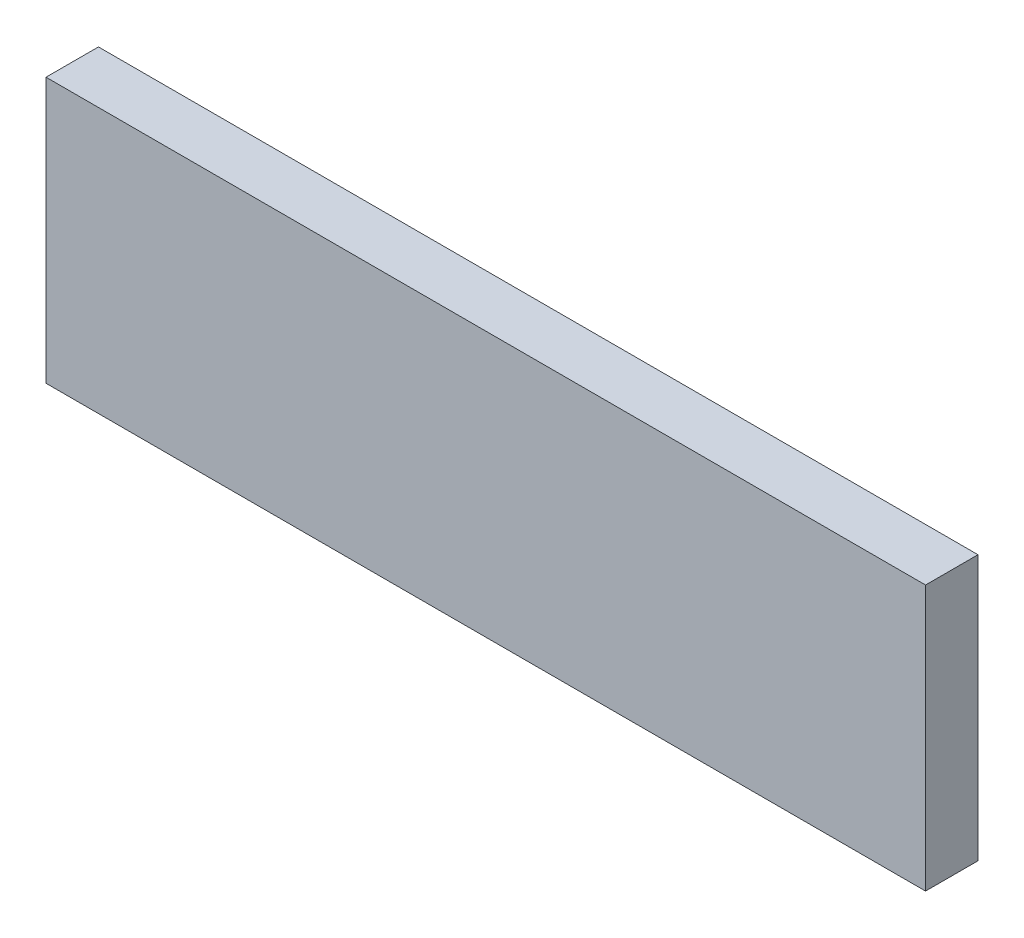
from build123d import *

# Parameters (mm, degrees)
SKIZZE1_W                       = 167.680604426
SKIZZE1_H                       = 50.537359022
AUFSATZ_LINEAR_AUSTRAGEN1_DEPTH = 10


with BuildPart() as part:
    # Skizze1 → Aufsatz-Linear austragen1 (new body)
    with BuildSketch(Plane.XY):
        Rectangle(SKIZZE1_W, SKIZZE1_H)
    extrude(amount=AUFSATZ_LINEAR_AUSTRAGEN1_DEPTH)


solid = part.part
